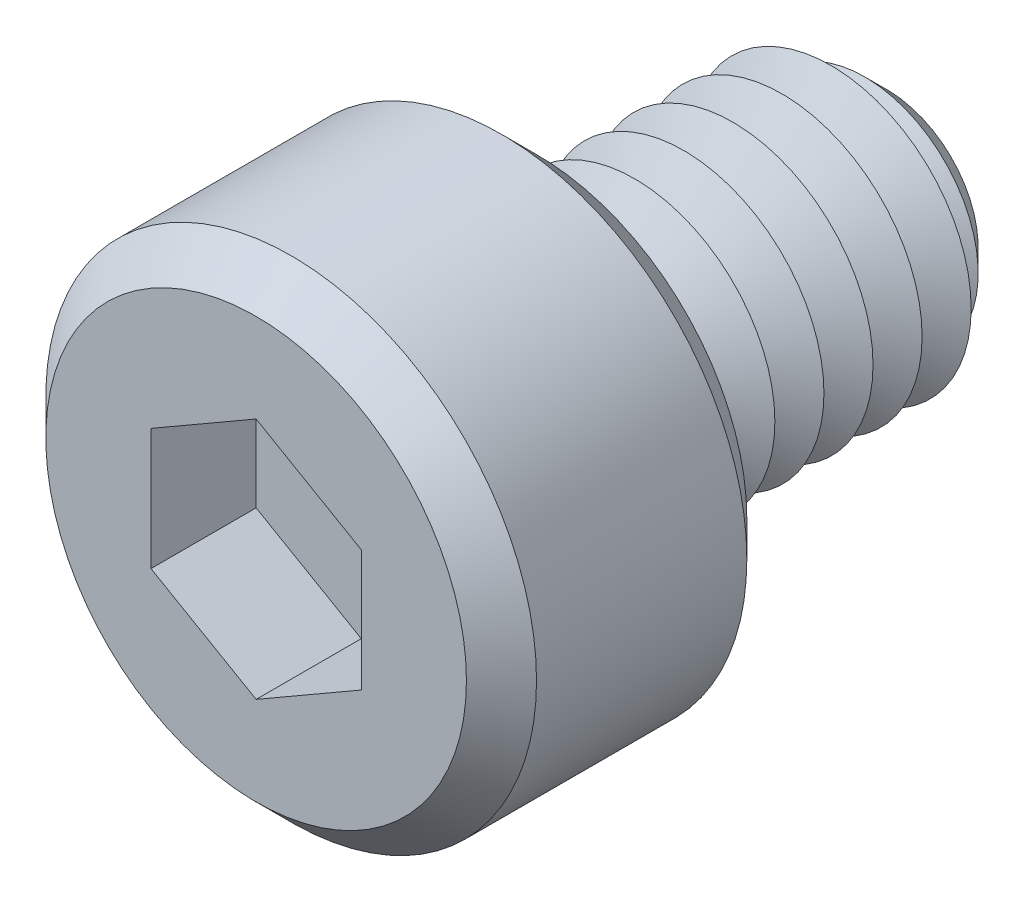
ISO-10303-21;
HEADER;
FILE_DESCRIPTION(('STEP AP214'),'2;1');
FILE_NAME('part.step','',(''),(''),'','','');
FILE_SCHEMA(('AUTOMOTIVE_DESIGN { 1 0 10303 214 1 1 1 1 }'));
ENDSEC;
DATA;
#1=APPLICATION_CONTEXT('core data for automotive mechanical design processes');
#2=APPLICATION_PROTOCOL_DEFINITION('international standard','automotive_design',2000,#1);
#3=PRODUCT_CONTEXT('',#1,'mechanical');
#4=PRODUCT('Part','Part','',(#3));
#5=PRODUCT_RELATED_PRODUCT_CATEGORY('part','',(#4));
#6=PRODUCT_DEFINITION_FORMATION('','',#4);
#7=PRODUCT_DEFINITION_CONTEXT('part definition',#1,'design');
#8=PRODUCT_DEFINITION('design','',#6,#7);
#9=PRODUCT_DEFINITION_SHAPE('','',#8);
#10=(LENGTH_UNIT() NAMED_UNIT(*) SI_UNIT(.MILLI.,.METRE.));
#11=(NAMED_UNIT(*) PLANE_ANGLE_UNIT() SI_UNIT($,.RADIAN.));
#12=(NAMED_UNIT(*) SI_UNIT($,.STERADIAN.) SOLID_ANGLE_UNIT());
#13=UNCERTAINTY_MEASURE_WITH_UNIT(LENGTH_MEASURE(1.E-05),#10,'distance_accuracy_value','');
#14=(GEOMETRIC_REPRESENTATION_CONTEXT(3) GLOBAL_UNCERTAINTY_ASSIGNED_CONTEXT((#13)) GLOBAL_UNIT_ASSIGNED_CONTEXT((#10,
#11,#12)) REPRESENTATION_CONTEXT('',''));
#15=CARTESIAN_POINT('',(0.,0.,0.));
#16=DIRECTION('',(0.,0.,1.));
#17=DIRECTION('',(1.,0.,0.));
#18=AXIS2_PLACEMENT_3D('',#15,#16,#17);
#19=CARTESIAN_POINT('',(0.,0.,4.));
#20=DIRECTION('',(0.,0.,-1.));
#21=DIRECTION('',(-1.,0.,0.));
#22=AXIS2_PLACEMENT_3D('',#19,#20,#21);
#23=CYLINDRICAL_SURFACE('',#22,3.5);
#24=CARTESIAN_POINT('',(0.,0.,0.5));
#25=DIRECTION('',(0.,0.,1.));
#26=DIRECTION('',(1.,0.,0.));
#27=AXIS2_PLACEMENT_3D('',#24,#25,#26);
#28=CIRCLE('',#27,3.5);
#29=CARTESIAN_POINT('',(3.5,0.,0.5));
#30=VERTEX_POINT('',#29);
#31=EDGE_CURVE('E232',#30,#30,#28,.T.);
#32=ORIENTED_EDGE('',*,*,#31,.T.);
#33=EDGE_LOOP('',(#32));
#34=FACE_BOUND('',#33,.T.);
#35=CARTESIAN_POINT('',(0.,0.,3.5));
#36=DIRECTION('',(0.,0.,1.));
#37=DIRECTION('',(1.,0.,0.));
#38=AXIS2_PLACEMENT_3D('',#35,#36,#37);
#39=CIRCLE('',#38,3.5);
#40=CARTESIAN_POINT('',(3.5,0.,3.5));
#41=VERTEX_POINT('',#40);
#42=EDGE_CURVE('E225',#41,#41,#39,.F.);
#43=ORIENTED_EDGE('',*,*,#42,.T.);
#44=EDGE_LOOP('',(#43));
#45=FACE_BOUND('',#44,.T.);
#46=ADVANCED_FACE('F39',(#34,#45),#23,.T.);
#47=CARTESIAN_POINT('',(0.,0.,4.));
#48=DIRECTION('',(0.,0.,1.));
#49=DIRECTION('',(1.,0.,0.));
#50=AXIS2_PLACEMENT_3D('',#47,#48,#49);
#51=PLANE('',#50);
#52=CARTESIAN_POINT('',(0.,0.,4.));
#53=DIRECTION('',(0.,0.,1.));
#54=DIRECTION('',(1.,0.,0.));
#55=AXIS2_PLACEMENT_3D('',#52,#53,#54);
#56=CIRCLE('',#55,3.);
#57=CARTESIAN_POINT('',(3.,0.,4.));
#58=VERTEX_POINT('',#57);
#59=EDGE_CURVE('E11',#58,#58,#56,.T.);
#60=ORIENTED_EDGE('',*,*,#59,.T.);
#61=EDGE_LOOP('',(#60));
#62=FACE_BOUND('',#61,.T.);
#63=DIRECTION('',(-0.866025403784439,0.5,0.));
#64=VECTOR('',#63,1.);
#65=CARTESIAN_POINT('',(1.5,0.86602540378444,4.));
#66=LINE('',#65,#64);
#67=CARTESIAN_POINT('',(1.5,0.86602540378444,4.));
#68=VERTEX_POINT('',#67);
#69=CARTESIAN_POINT('',(0.,1.73205080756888,4.));
#70=VERTEX_POINT('',#69);
#71=EDGE_CURVE('E55',#68,#70,#66,.T.);
#72=ORIENTED_EDGE('',*,*,#71,.F.);
#73=DIRECTION('',(0.,1.,0.));
#74=VECTOR('',#73,1.);
#75=CARTESIAN_POINT('',(1.5,-0.866025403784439,4.));
#76=LINE('',#75,#74);
#77=CARTESIAN_POINT('',(1.5,-0.866025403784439,4.));
#78=VERTEX_POINT('',#77);
#79=EDGE_CURVE('E151',#78,#68,#76,.T.);
#80=ORIENTED_EDGE('',*,*,#79,.F.);
#81=DIRECTION('',(0.866025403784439,0.5,0.));
#82=VECTOR('',#81,1.);
#83=CARTESIAN_POINT('',(0.,-1.73205080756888,4.));
#84=LINE('',#83,#82);
#85=CARTESIAN_POINT('',(0.,-1.73205080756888,4.));
#86=VERTEX_POINT('',#85);
#87=EDGE_CURVE('E148',#86,#78,#84,.T.);
#88=ORIENTED_EDGE('',*,*,#87,.F.);
#89=DIRECTION('',(0.866025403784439,-0.5,0.));
#90=VECTOR('',#89,1.);
#91=CARTESIAN_POINT('',(-1.5,-0.866025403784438,4.));
#92=LINE('',#91,#90);
#93=CARTESIAN_POINT('',(-1.5,-0.866025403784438,4.));
#94=VERTEX_POINT('',#93);
#95=EDGE_CURVE('E103',#94,#86,#92,.T.);
#96=ORIENTED_EDGE('',*,*,#95,.F.);
#97=DIRECTION('',(0.,-1.,0.));
#98=VECTOR('',#97,1.);
#99=CARTESIAN_POINT('',(-1.5,0.86602540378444,4.));
#100=LINE('',#99,#98);
#101=CARTESIAN_POINT('',(-1.5,0.86602540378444,4.));
#102=VERTEX_POINT('',#101);
#103=EDGE_CURVE('E142',#102,#94,#100,.T.);
#104=ORIENTED_EDGE('',*,*,#103,.F.);
#105=DIRECTION('',(-0.866025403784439,-0.5,0.));
#106=VECTOR('',#105,1.);
#107=CARTESIAN_POINT('',(0.,1.73205080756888,4.));
#108=LINE('',#107,#106);
#109=EDGE_CURVE('E137',#70,#102,#108,.T.);
#110=ORIENTED_EDGE('',*,*,#109,.F.);
#111=EDGE_LOOP('',(#72,#80,#88,#96,#104,#110));
#112=FACE_BOUND('',#111,.T.);
#113=ADVANCED_FACE('F250',(#62,#112),#51,.T.);
#114=CARTESIAN_POINT('',(0.,0.,0.));
#115=DIRECTION('',(0.,0.,1.));
#116=DIRECTION('',(1.,0.,0.));
#117=AXIS2_PLACEMENT_3D('',#114,#115,#116);
#118=PLANE('',#117);
#119=CARTESIAN_POINT('',(0.,0.,0.));
#120=DIRECTION('',(0.,0.,1.));
#121=DIRECTION('',(1.,0.,0.));
#122=AXIS2_PLACEMENT_3D('',#119,#120,#121);
#123=CIRCLE('',#122,3.);
#124=CARTESIAN_POINT('',(3.,0.,0.));
#125=VERTEX_POINT('',#124);
#126=EDGE_CURVE('E48',#125,#125,#123,.F.);
#127=ORIENTED_EDGE('',*,*,#126,.T.);
#128=EDGE_LOOP('',(#127));
#129=FACE_BOUND('',#128,.T.);
#130=CARTESIAN_POINT('',(0.,0.,0.));
#131=DIRECTION('',(0.,0.,1.));
#132=DIRECTION('',(1.,0.,0.));
#133=AXIS2_PLACEMENT_3D('',#130,#131,#132);
#134=CIRCLE('',#133,2.);
#135=CARTESIAN_POINT('',(2.,0.,0.));
#136=VERTEX_POINT('',#135);
#137=EDGE_CURVE('E218',#136,#136,#134,.T.);
#138=ORIENTED_EDGE('',*,*,#137,.T.);
#139=EDGE_LOOP('',(#138));
#140=FACE_BOUND('',#139,.T.);
#141=ADVANCED_FACE('F239',(#129,#140),#118,.F.);
#142=CARTESIAN_POINT('',(0.,0.,0.));
#143=DIRECTION('',(0.,0.,1.));
#144=DIRECTION('',(1.,0.,0.));
#145=AXIS2_PLACEMENT_3D('',#142,#143,#144);
#146=CONICAL_SURFACE('',#145,2.,1.0471975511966);
#147=CARTESIAN_POINT('',(0.,0.,-0.35));
#148=DIRECTION('',(0.,0.,1.));
#149=DIRECTION('',(1.,0.,0.));
#150=AXIS2_PLACEMENT_3D('',#147,#148,#149);
#151=CIRCLE('',#150,1.39378221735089);
#152=CARTESIAN_POINT('',(1.39378221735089,0.,-0.35));
#153=VERTEX_POINT('',#152);
#154=EDGE_CURVE('E214',#153,#153,#151,.T.);
#155=ORIENTED_EDGE('',*,*,#154,.T.);
#156=EDGE_LOOP('',(#155));
#157=FACE_BOUND('',#156,.T.);
#158=ORIENTED_EDGE('',*,*,#137,.F.);
#159=EDGE_LOOP('',(#158));
#160=FACE_BOUND('',#159,.T.);
#161=ADVANCED_FACE('F356',(#157,#160),#146,.T.);
#162=CARTESIAN_POINT('',(0.,0.,-0.35));
#163=DIRECTION('',(0.,0.,-1.));
#164=DIRECTION('',(-1.,0.,0.));
#165=AXIS2_PLACEMENT_3D('',#162,#163,#164);
#166=CONICAL_SURFACE('',#165,1.39378221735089,1.0471975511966);
#167=CARTESIAN_POINT('',(0.,0.,-0.7));
#168=DIRECTION('',(0.,0.,1.));
#169=DIRECTION('',(1.,0.,0.));
#170=AXIS2_PLACEMENT_3D('',#167,#168,#169);
#171=CIRCLE('',#170,2.);
#172=CARTESIAN_POINT('',(2.,0.,-0.7));
#173=VERTEX_POINT('',#172);
#174=EDGE_CURVE('E210',#173,#173,#171,.T.);
#175=ORIENTED_EDGE('',*,*,#174,.T.);
#176=EDGE_LOOP('',(#175));
#177=FACE_BOUND('',#176,.T.);
#178=ORIENTED_EDGE('',*,*,#154,.F.);
#179=EDGE_LOOP('',(#178));
#180=FACE_BOUND('',#179,.T.);
#181=ADVANCED_FACE('F352',(#177,#180),#166,.T.);
#182=CARTESIAN_POINT('',(0.,0.,-0.7));
#183=DIRECTION('',(0.,0.,1.));
#184=DIRECTION('',(1.,0.,0.));
#185=AXIS2_PLACEMENT_3D('',#182,#183,#184);
#186=CONICAL_SURFACE('',#185,2.,1.0471975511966);
#187=CARTESIAN_POINT('',(0.,0.,-1.05));
#188=DIRECTION('',(0.,0.,1.));
#189=DIRECTION('',(1.,0.,0.));
#190=AXIS2_PLACEMENT_3D('',#187,#188,#189);
#191=CIRCLE('',#190,1.39378221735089);
#192=CARTESIAN_POINT('',(1.39378221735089,0.,-1.05));
#193=VERTEX_POINT('',#192);
#194=EDGE_CURVE('E206',#193,#193,#191,.T.);
#195=ORIENTED_EDGE('',*,*,#194,.T.);
#196=EDGE_LOOP('',(#195));
#197=FACE_BOUND('',#196,.T.);
#198=ORIENTED_EDGE('',*,*,#174,.F.);
#199=EDGE_LOOP('',(#198));
#200=FACE_BOUND('',#199,.T.);
#201=ADVANCED_FACE('F348',(#197,#200),#186,.T.);
#202=CARTESIAN_POINT('',(0.,0.,-1.05));
#203=DIRECTION('',(0.,0.,-1.));
#204=DIRECTION('',(-1.,0.,0.));
#205=AXIS2_PLACEMENT_3D('',#202,#203,#204);
#206=CONICAL_SURFACE('',#205,1.39378221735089,1.0471975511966);
#207=CARTESIAN_POINT('',(0.,0.,-1.4));
#208=DIRECTION('',(0.,0.,1.));
#209=DIRECTION('',(1.,0.,0.));
#210=AXIS2_PLACEMENT_3D('',#207,#208,#209);
#211=CIRCLE('',#210,2.);
#212=CARTESIAN_POINT('',(2.,0.,-1.4));
#213=VERTEX_POINT('',#212);
#214=EDGE_CURVE('E202',#213,#213,#211,.T.);
#215=ORIENTED_EDGE('',*,*,#214,.T.);
#216=EDGE_LOOP('',(#215));
#217=FACE_BOUND('',#216,.T.);
#218=ORIENTED_EDGE('',*,*,#194,.F.);
#219=EDGE_LOOP('',(#218));
#220=FACE_BOUND('',#219,.T.);
#221=ADVANCED_FACE('F344',(#217,#220),#206,.T.);
#222=CARTESIAN_POINT('',(0.,0.,-1.4));
#223=DIRECTION('',(0.,0.,1.));
#224=DIRECTION('',(1.,0.,0.));
#225=AXIS2_PLACEMENT_3D('',#222,#223,#224);
#226=CONICAL_SURFACE('',#225,2.,1.0471975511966);
#227=CARTESIAN_POINT('',(0.,0.,-1.75));
#228=DIRECTION('',(0.,0.,1.));
#229=DIRECTION('',(1.,0.,0.));
#230=AXIS2_PLACEMENT_3D('',#227,#228,#229);
#231=CIRCLE('',#230,1.39378221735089);
#232=CARTESIAN_POINT('',(1.39378221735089,0.,-1.75));
#233=VERTEX_POINT('',#232);
#234=EDGE_CURVE('E199',#233,#233,#231,.T.);
#235=ORIENTED_EDGE('',*,*,#234,.T.);
#236=EDGE_LOOP('',(#235));
#237=FACE_BOUND('',#236,.T.);
#238=ORIENTED_EDGE('',*,*,#214,.F.);
#239=EDGE_LOOP('',(#238));
#240=FACE_BOUND('',#239,.T.);
#241=ADVANCED_FACE('F340',(#237,#240),#226,.T.);
#242=CARTESIAN_POINT('',(0.,0.,-1.75));
#243=DIRECTION('',(0.,0.,-1.));
#244=DIRECTION('',(-1.,0.,0.));
#245=AXIS2_PLACEMENT_3D('',#242,#243,#244);
#246=CONICAL_SURFACE('',#245,1.39378221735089,1.0471975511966);
#247=CARTESIAN_POINT('',(0.,0.,-2.1));
#248=DIRECTION('',(0.,0.,1.));
#249=DIRECTION('',(1.,0.,0.));
#250=AXIS2_PLACEMENT_3D('',#247,#248,#249);
#251=CIRCLE('',#250,2.);
#252=CARTESIAN_POINT('',(2.,0.,-2.1));
#253=VERTEX_POINT('',#252);
#254=EDGE_CURVE('E195',#253,#253,#251,.T.);
#255=ORIENTED_EDGE('',*,*,#254,.T.);
#256=EDGE_LOOP('',(#255));
#257=FACE_BOUND('',#256,.T.);
#258=ORIENTED_EDGE('',*,*,#234,.F.);
#259=EDGE_LOOP('',(#258));
#260=FACE_BOUND('',#259,.T.);
#261=ADVANCED_FACE('F336',(#257,#260),#246,.T.);
#262=CARTESIAN_POINT('',(0.,0.,-2.1));
#263=DIRECTION('',(0.,0.,1.));
#264=DIRECTION('',(1.,0.,0.));
#265=AXIS2_PLACEMENT_3D('',#262,#263,#264);
#266=CONICAL_SURFACE('',#265,2.,1.0471975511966);
#267=CARTESIAN_POINT('',(0.,0.,-2.45));
#268=DIRECTION('',(0.,0.,1.));
#269=DIRECTION('',(1.,0.,0.));
#270=AXIS2_PLACEMENT_3D('',#267,#268,#269);
#271=CIRCLE('',#270,1.39378221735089);
#272=CARTESIAN_POINT('',(1.39378221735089,0.,-2.45));
#273=VERTEX_POINT('',#272);
#274=EDGE_CURVE('E191',#273,#273,#271,.T.);
#275=ORIENTED_EDGE('',*,*,#274,.T.);
#276=EDGE_LOOP('',(#275));
#277=FACE_BOUND('',#276,.T.);
#278=ORIENTED_EDGE('',*,*,#254,.F.);
#279=EDGE_LOOP('',(#278));
#280=FACE_BOUND('',#279,.T.);
#281=ADVANCED_FACE('F332',(#277,#280),#266,.T.);
#282=CARTESIAN_POINT('',(0.,0.,-2.45));
#283=DIRECTION('',(0.,0.,-1.));
#284=DIRECTION('',(-1.,0.,0.));
#285=AXIS2_PLACEMENT_3D('',#282,#283,#284);
#286=CONICAL_SURFACE('',#285,1.39378221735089,1.0471975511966);
#287=CARTESIAN_POINT('',(0.,0.,-2.8));
#288=DIRECTION('',(0.,0.,1.));
#289=DIRECTION('',(1.,0.,0.));
#290=AXIS2_PLACEMENT_3D('',#287,#288,#289);
#291=CIRCLE('',#290,2.);
#292=CARTESIAN_POINT('',(2.,0.,-2.8));
#293=VERTEX_POINT('',#292);
#294=EDGE_CURVE('E187',#293,#293,#291,.T.);
#295=ORIENTED_EDGE('',*,*,#294,.T.);
#296=EDGE_LOOP('',(#295));
#297=FACE_BOUND('',#296,.T.);
#298=ORIENTED_EDGE('',*,*,#274,.F.);
#299=EDGE_LOOP('',(#298));
#300=FACE_BOUND('',#299,.T.);
#301=ADVANCED_FACE('F328',(#297,#300),#286,.T.);
#302=CARTESIAN_POINT('',(0.,0.,-2.8));
#303=DIRECTION('',(0.,0.,1.));
#304=DIRECTION('',(1.,0.,0.));
#305=AXIS2_PLACEMENT_3D('',#302,#303,#304);
#306=CONICAL_SURFACE('',#305,2.,1.0471975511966);
#307=CARTESIAN_POINT('',(0.,0.,-3.15));
#308=DIRECTION('',(0.,0.,1.));
#309=DIRECTION('',(1.,0.,0.));
#310=AXIS2_PLACEMENT_3D('',#307,#308,#309);
#311=CIRCLE('',#310,1.39378221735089);
#312=CARTESIAN_POINT('',(1.39378221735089,0.,-3.15));
#313=VERTEX_POINT('',#312);
#314=EDGE_CURVE('E183',#313,#313,#311,.T.);
#315=ORIENTED_EDGE('',*,*,#314,.T.);
#316=EDGE_LOOP('',(#315));
#317=FACE_BOUND('',#316,.T.);
#318=ORIENTED_EDGE('',*,*,#294,.F.);
#319=EDGE_LOOP('',(#318));
#320=FACE_BOUND('',#319,.T.);
#321=ADVANCED_FACE('F324',(#317,#320),#306,.T.);
#322=CARTESIAN_POINT('',(0.,0.,-3.15));
#323=DIRECTION('',(0.,0.,-1.));
#324=DIRECTION('',(-1.,0.,0.));
#325=AXIS2_PLACEMENT_3D('',#322,#323,#324);
#326=CONICAL_SURFACE('',#325,1.39378221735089,1.0471975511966);
#327=CARTESIAN_POINT('',(0.,0.,-3.5));
#328=DIRECTION('',(0.,0.,1.));
#329=DIRECTION('',(1.,0.,0.));
#330=AXIS2_PLACEMENT_3D('',#327,#328,#329);
#331=CIRCLE('',#330,2.);
#332=CARTESIAN_POINT('',(2.,0.,-3.5));
#333=VERTEX_POINT('',#332);
#334=EDGE_CURVE('E179',#333,#333,#331,.T.);
#335=ORIENTED_EDGE('',*,*,#334,.T.);
#336=EDGE_LOOP('',(#335));
#337=FACE_BOUND('',#336,.T.);
#338=ORIENTED_EDGE('',*,*,#314,.F.);
#339=EDGE_LOOP('',(#338));
#340=FACE_BOUND('',#339,.T.);
#341=ADVANCED_FACE('F320',(#337,#340),#326,.T.);
#342=CARTESIAN_POINT('',(0.,0.,-3.5));
#343=DIRECTION('',(0.,0.,1.));
#344=DIRECTION('',(1.,0.,0.));
#345=AXIS2_PLACEMENT_3D('',#342,#343,#344);
#346=CONICAL_SURFACE('',#345,2.,1.0471975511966);
#347=CARTESIAN_POINT('',(0.,0.,-3.85));
#348=DIRECTION('',(0.,0.,1.));
#349=DIRECTION('',(1.,0.,0.));
#350=AXIS2_PLACEMENT_3D('',#347,#348,#349);
#351=CIRCLE('',#350,1.39378221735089);
#352=CARTESIAN_POINT('',(1.39378221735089,0.,-3.85));
#353=VERTEX_POINT('',#352);
#354=EDGE_CURVE('E175',#353,#353,#351,.T.);
#355=ORIENTED_EDGE('',*,*,#354,.T.);
#356=EDGE_LOOP('',(#355));
#357=FACE_BOUND('',#356,.T.);
#358=ORIENTED_EDGE('',*,*,#334,.F.);
#359=EDGE_LOOP('',(#358));
#360=FACE_BOUND('',#359,.T.);
#361=ADVANCED_FACE('F316',(#357,#360),#346,.T.);
#362=CARTESIAN_POINT('',(0.,0.,-3.85));
#363=DIRECTION('',(0.,0.,-1.));
#364=DIRECTION('',(-1.,0.,0.));
#365=AXIS2_PLACEMENT_3D('',#362,#363,#364);
#366=CONICAL_SURFACE('',#365,1.39378221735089,1.0471975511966);
#367=CARTESIAN_POINT('',(0.,0.,-4.2));
#368=DIRECTION('',(0.,0.,1.));
#369=DIRECTION('',(1.,0.,0.));
#370=AXIS2_PLACEMENT_3D('',#367,#368,#369);
#371=CIRCLE('',#370,2.);
#372=CARTESIAN_POINT('',(2.,0.,-4.2));
#373=VERTEX_POINT('',#372);
#374=EDGE_CURVE('E170',#373,#373,#371,.T.);
#375=ORIENTED_EDGE('',*,*,#374,.T.);
#376=EDGE_LOOP('',(#375));
#377=FACE_BOUND('',#376,.T.);
#378=ORIENTED_EDGE('',*,*,#354,.F.);
#379=EDGE_LOOP('',(#378));
#380=FACE_BOUND('',#379,.T.);
#381=ADVANCED_FACE('F312',(#377,#380),#366,.T.);
#382=CARTESIAN_POINT('',(0.,0.,-4.2));
#383=DIRECTION('',(0.,0.,1.));
#384=DIRECTION('',(1.,0.,0.));
#385=AXIS2_PLACEMENT_3D('',#382,#383,#384);
#386=CONICAL_SURFACE('',#385,2.,1.0471975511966);
#387=CARTESIAN_POINT('',(0.,0.,-4.55));
#388=DIRECTION('',(0.,0.,1.));
#389=DIRECTION('',(1.,0.,0.));
#390=AXIS2_PLACEMENT_3D('',#387,#388,#389);
#391=CIRCLE('',#390,1.39378221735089);
#392=CARTESIAN_POINT('',(1.39378221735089,0.,-4.55));
#393=VERTEX_POINT('',#392);
#394=EDGE_CURVE('E157',#393,#393,#391,.T.);
#395=ORIENTED_EDGE('',*,*,#394,.T.);
#396=EDGE_LOOP('',(#395));
#397=FACE_BOUND('',#396,.T.);
#398=ORIENTED_EDGE('',*,*,#374,.F.);
#399=EDGE_LOOP('',(#398));
#400=FACE_BOUND('',#399,.T.);
#401=ADVANCED_FACE('F308',(#397,#400),#386,.T.);
#402=CARTESIAN_POINT('',(0.,0.,-4.55));
#403=DIRECTION('',(0.,0.,-1.));
#404=DIRECTION('',(-1.,0.,0.));
#405=AXIS2_PLACEMENT_3D('',#402,#403,#404);
#406=CONICAL_SURFACE('',#405,1.39378221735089,1.0471975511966);
#407=CARTESIAN_POINT('',(0.,0.,-4.68038475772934));
#408=DIRECTION('',(0.,0.,-1.));
#409=DIRECTION('',(-1.,0.,0.));
#410=AXIS2_PLACEMENT_3D('',#407,#408,#409);
#411=CIRCLE('',#410,1.61961524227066);
#412=CARTESIAN_POINT('',(-1.61961524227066,0.,-4.68038475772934));
#413=VERTEX_POINT('',#412);
#414=EDGE_CURVE('E174',#413,#413,#411,.T.);
#415=ORIENTED_EDGE('',*,*,#414,.F.);
#416=EDGE_LOOP('',(#415));
#417=FACE_BOUND('',#416,.T.);
#418=ORIENTED_EDGE('',*,*,#394,.F.);
#419=EDGE_LOOP('',(#418));
#420=FACE_BOUND('',#419,.T.);
#421=ADVANCED_FACE('F304',(#417,#420),#406,.T.);
#422=CARTESIAN_POINT('',(0.,0.,-5.));
#423=DIRECTION('',(0.,0.,-1.));
#424=DIRECTION('',(-1.,0.,0.));
#425=AXIS2_PLACEMENT_3D('',#422,#423,#424);
#426=PLANE('',#425);
#427=CARTESIAN_POINT('',(0.,0.,-5.));
#428=DIRECTION('',(0.,0.,-1.));
#429=DIRECTION('',(-1.,0.,0.));
#430=AXIS2_PLACEMENT_3D('',#427,#428,#429);
#431=CIRCLE('',#430,0.5);
#432=CARTESIAN_POINT('',(-0.5,0.,-5.));
#433=VERTEX_POINT('',#432);
#434=EDGE_CURVE('E138',#433,#433,#431,.F.);
#435=ORIENTED_EDGE('',*,*,#434,.T.);
#436=EDGE_LOOP('',(#435));
#437=FACE_BOUND('',#436,.T.);
#438=CARTESIAN_POINT('',(0.,0.,-5.));
#439=DIRECTION('',(0.,0.,-1.));
#440=DIRECTION('',(-1.,0.,0.));
#441=AXIS2_PLACEMENT_3D('',#438,#439,#440);
#442=CIRCLE('',#441,1.3);
#443=CARTESIAN_POINT('',(-1.3,0.,-5.));
#444=VERTEX_POINT('',#443);
#445=EDGE_CURVE('E222',#444,#444,#442,.T.);
#446=ORIENTED_EDGE('',*,*,#445,.T.);
#447=EDGE_LOOP('',(#446));
#448=FACE_BOUND('',#447,.T.);
#449=ADVANCED_FACE('F307',(#437,#448),#426,.T.);
#450=CARTESIAN_POINT('',(0.,0.,-5.));
#451=DIRECTION('',(0.,0.,1.));
#452=DIRECTION('',(1.,0.,0.));
#453=AXIS2_PLACEMENT_3D('',#450,#451,#452);
#454=CONICAL_SURFACE('',#453,1.3,0.785398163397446);
#455=ORIENTED_EDGE('',*,*,#445,.F.);
#456=EDGE_LOOP('',(#455));
#457=FACE_BOUND('',#456,.T.);
#458=ORIENTED_EDGE('',*,*,#414,.T.);
#459=EDGE_LOOP('',(#458));
#460=FACE_BOUND('',#459,.T.);
#461=ADVANCED_FACE('F303',(#457,#460),#454,.T.);
#462=CARTESIAN_POINT('',(1.5,0.86602540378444,2.5));
#463=DIRECTION('',(0.5,0.866025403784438,0.));
#464=DIRECTION('',(-0.866025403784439,0.5,0.));
#465=AXIS2_PLACEMENT_3D('',#462,#463,#464);
#466=PLANE('',#465);
#467=ORIENTED_EDGE('',*,*,#71,.T.);
#468=DIRECTION('',(0.,0.,1.));
#469=VECTOR('',#468,1.);
#470=CARTESIAN_POINT('',(0.,1.73205080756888,2.5));
#471=LINE('',#470,#469);
#472=CARTESIAN_POINT('',(0.,1.73205080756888,2.5));
#473=VERTEX_POINT('',#472);
#474=EDGE_CURVE('E85',#473,#70,#471,.T.);
#475=ORIENTED_EDGE('',*,*,#474,.F.);
#476=DIRECTION('',(-0.866025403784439,0.5,0.));
#477=VECTOR('',#476,1.);
#478=CARTESIAN_POINT('',(1.5,0.86602540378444,2.5));
#479=LINE('',#478,#477);
#480=CARTESIAN_POINT('',(1.5,0.86602540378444,2.5));
#481=VERTEX_POINT('',#480);
#482=EDGE_CURVE('E154',#481,#473,#479,.T.);
#483=ORIENTED_EDGE('',*,*,#482,.F.);
#484=DIRECTION('',(0.,0.,1.));
#485=VECTOR('',#484,1.);
#486=CARTESIAN_POINT('',(1.5,0.86602540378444,2.5));
#487=LINE('',#486,#485);
#488=EDGE_CURVE('E63',#481,#68,#487,.T.);
#489=ORIENTED_EDGE('',*,*,#488,.T.);
#490=EDGE_LOOP('',(#467,#475,#483,#489));
#491=FACE_BOUND('',#490,.T.);
#492=ADVANCED_FACE('F293',(#491),#466,.F.);
#493=CARTESIAN_POINT('',(1.5,-0.866025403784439,2.5));
#494=DIRECTION('',(1.,0.,0.));
#495=DIRECTION('',(0.,0.,-1.));
#496=AXIS2_PLACEMENT_3D('',#493,#494,#495);
#497=PLANE('',#496);
#498=ORIENTED_EDGE('',*,*,#79,.T.);
#499=ORIENTED_EDGE('',*,*,#488,.F.);
#500=DIRECTION('',(0.,1.,0.));
#501=VECTOR('',#500,1.);
#502=CARTESIAN_POINT('',(1.5,-0.866025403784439,2.5));
#503=LINE('',#502,#501);
#504=CARTESIAN_POINT('',(1.5,-0.866025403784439,2.5));
#505=VERTEX_POINT('',#504);
#506=EDGE_CURVE('E117',#505,#481,#503,.T.);
#507=ORIENTED_EDGE('',*,*,#506,.F.);
#508=DIRECTION('',(0.,0.,1.));
#509=VECTOR('',#508,1.);
#510=CARTESIAN_POINT('',(1.5,-0.866025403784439,2.5));
#511=LINE('',#510,#509);
#512=EDGE_CURVE('E108',#505,#78,#511,.T.);
#513=ORIENTED_EDGE('',*,*,#512,.T.);
#514=EDGE_LOOP('',(#498,#499,#507,#513));
#515=FACE_BOUND('',#514,.T.);
#516=ADVANCED_FACE('F290',(#515),#497,.F.);
#517=CARTESIAN_POINT('',(0.,-1.73205080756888,2.5));
#518=DIRECTION('',(0.5,-0.866025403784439,0.));
#519=DIRECTION('',(0.866025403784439,0.5,0.));
#520=AXIS2_PLACEMENT_3D('',#517,#518,#519);
#521=PLANE('',#520);
#522=ORIENTED_EDGE('',*,*,#87,.T.);
#523=ORIENTED_EDGE('',*,*,#512,.F.);
#524=DIRECTION('',(0.866025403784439,0.5,0.));
#525=VECTOR('',#524,1.);
#526=CARTESIAN_POINT('',(0.,-1.73205080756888,2.5));
#527=LINE('',#526,#525);
#528=CARTESIAN_POINT('',(0.,-1.73205080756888,2.5));
#529=VERTEX_POINT('',#528);
#530=EDGE_CURVE('E112',#529,#505,#527,.T.);
#531=ORIENTED_EDGE('',*,*,#530,.F.);
#532=DIRECTION('',(0.,0.,1.));
#533=VECTOR('',#532,1.);
#534=CARTESIAN_POINT('',(0.,-1.73205080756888,2.5));
#535=LINE('',#534,#533);
#536=EDGE_CURVE('E96',#529,#86,#535,.T.);
#537=ORIENTED_EDGE('',*,*,#536,.T.);
#538=EDGE_LOOP('',(#522,#523,#531,#537));
#539=FACE_BOUND('',#538,.T.);
#540=ADVANCED_FACE('F113',(#539),#521,.F.);
#541=CARTESIAN_POINT('',(-1.5,-0.866025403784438,2.5));
#542=DIRECTION('',(-0.5,-0.866025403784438,0.));
#543=DIRECTION('',(0.866025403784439,-0.5,0.));
#544=AXIS2_PLACEMENT_3D('',#541,#542,#543);
#545=PLANE('',#544);
#546=ORIENTED_EDGE('',*,*,#95,.T.);
#547=ORIENTED_EDGE('',*,*,#536,.F.);
#548=DIRECTION('',(0.866025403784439,-0.5,0.));
#549=VECTOR('',#548,1.);
#550=CARTESIAN_POINT('',(-1.5,-0.866025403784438,2.5));
#551=LINE('',#550,#549);
#552=CARTESIAN_POINT('',(-1.5,-0.866025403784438,2.5));
#553=VERTEX_POINT('',#552);
#554=EDGE_CURVE('E100',#553,#529,#551,.T.);
#555=ORIENTED_EDGE('',*,*,#554,.F.);
#556=DIRECTION('',(0.,0.,1.));
#557=VECTOR('',#556,1.);
#558=CARTESIAN_POINT('',(-1.5,-0.866025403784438,2.5));
#559=LINE('',#558,#557);
#560=EDGE_CURVE('E109',#553,#94,#559,.T.);
#561=ORIENTED_EDGE('',*,*,#560,.T.);
#562=EDGE_LOOP('',(#546,#547,#555,#561));
#563=FACE_BOUND('',#562,.T.);
#564=ADVANCED_FACE('F98',(#563),#545,.F.);
#565=CARTESIAN_POINT('',(-1.5,0.86602540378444,2.5));
#566=DIRECTION('',(-1.,0.,0.));
#567=DIRECTION('',(0.,0.,1.));
#568=AXIS2_PLACEMENT_3D('',#565,#566,#567);
#569=PLANE('',#568);
#570=ORIENTED_EDGE('',*,*,#103,.T.);
#571=ORIENTED_EDGE('',*,*,#560,.F.);
#572=DIRECTION('',(0.,-1.,0.));
#573=VECTOR('',#572,1.);
#574=CARTESIAN_POINT('',(-1.5,0.86602540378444,2.5));
#575=LINE('',#574,#573);
#576=CARTESIAN_POINT('',(-1.5,0.86602540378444,2.5));
#577=VERTEX_POINT('',#576);
#578=EDGE_CURVE('E123',#577,#553,#575,.T.);
#579=ORIENTED_EDGE('',*,*,#578,.F.);
#580=DIRECTION('',(0.,0.,1.));
#581=VECTOR('',#580,1.);
#582=CARTESIAN_POINT('',(-1.5,0.86602540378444,2.5));
#583=LINE('',#582,#581);
#584=EDGE_CURVE('E162',#577,#102,#583,.T.);
#585=ORIENTED_EDGE('',*,*,#584,.T.);
#586=EDGE_LOOP('',(#570,#571,#579,#585));
#587=FACE_BOUND('',#586,.T.);
#588=ADVANCED_FACE('F287',(#587),#569,.F.);
#589=CARTESIAN_POINT('',(0.,1.73205080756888,2.5));
#590=DIRECTION('',(-0.5,0.866025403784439,0.));
#591=DIRECTION('',(-0.866025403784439,-0.5,0.));
#592=AXIS2_PLACEMENT_3D('',#589,#590,#591);
#593=PLANE('',#592);
#594=ORIENTED_EDGE('',*,*,#109,.T.);
#595=ORIENTED_EDGE('',*,*,#584,.F.);
#596=DIRECTION('',(-0.866025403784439,-0.5,0.));
#597=VECTOR('',#596,1.);
#598=CARTESIAN_POINT('',(0.,1.73205080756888,2.5));
#599=LINE('',#598,#597);
#600=EDGE_CURVE('E129',#473,#577,#599,.T.);
#601=ORIENTED_EDGE('',*,*,#600,.F.);
#602=ORIENTED_EDGE('',*,*,#474,.T.);
#603=EDGE_LOOP('',(#594,#595,#601,#602));
#604=FACE_BOUND('',#603,.T.);
#605=ADVANCED_FACE('F265',(#604),#593,.F.);
#606=CARTESIAN_POINT('',(0.,0.,2.5));
#607=DIRECTION('',(0.,0.,1.));
#608=DIRECTION('',(1.,0.,0.));
#609=AXIS2_PLACEMENT_3D('',#606,#607,#608);
#610=PLANE('',#609);
#611=CARTESIAN_POINT('',(0.,0.,2.5));
#612=DIRECTION('',(0.,0.,1.));
#613=DIRECTION('',(1.,0.,0.));
#614=AXIS2_PLACEMENT_3D('',#611,#612,#613);
#615=CIRCLE('',#614,0.5);
#616=CARTESIAN_POINT('',(0.5,0.,2.5));
#617=VERTEX_POINT('',#616);
#618=EDGE_CURVE('E273',#617,#617,#615,.T.);
#619=ORIENTED_EDGE('',*,*,#618,.F.);
#620=EDGE_LOOP('',(#619));
#621=FACE_BOUND('',#620,.T.);
#622=ORIENTED_EDGE('',*,*,#482,.T.);
#623=ORIENTED_EDGE('',*,*,#600,.T.);
#624=ORIENTED_EDGE('',*,*,#578,.T.);
#625=ORIENTED_EDGE('',*,*,#554,.T.);
#626=ORIENTED_EDGE('',*,*,#530,.T.);
#627=ORIENTED_EDGE('',*,*,#506,.T.);
#628=EDGE_LOOP('',(#622,#623,#624,#625,#626,#627));
#629=FACE_BOUND('',#628,.T.);
#630=ADVANCED_FACE('F120',(#621,#629),#610,.T.);
#631=CARTESIAN_POINT('',(0.,0.,-6.41421356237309));
#632=DIRECTION('',(0.,0.,1.));
#633=DIRECTION('',(1.,0.,0.));
#634=AXIS2_PLACEMENT_3D('',#631,#632,#633);
#635=CYLINDRICAL_SURFACE('',#634,0.5);
#636=ORIENTED_EDGE('',*,*,#618,.T.);
#637=EDGE_LOOP('',(#636));
#638=FACE_BOUND('',#637,.T.);
#639=ORIENTED_EDGE('',*,*,#434,.F.);
#640=EDGE_LOOP('',(#639));
#641=FACE_BOUND('',#640,.T.);
#642=ADVANCED_FACE('F245',(#638,#641),#635,.F.);
#643=CARTESIAN_POINT('',(0.,0.,0.5));
#644=DIRECTION('',(0.,0.,1.));
#645=DIRECTION('',(1.,0.,0.));
#646=AXIS2_PLACEMENT_3D('',#643,#644,#645);
#647=CONICAL_SURFACE('',#646,3.5,0.78539816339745);
#648=ORIENTED_EDGE('',*,*,#126,.F.);
#649=EDGE_LOOP('',(#648));
#650=FACE_BOUND('',#649,.T.);
#651=ORIENTED_EDGE('',*,*,#31,.F.);
#652=EDGE_LOOP('',(#651));
#653=FACE_BOUND('',#652,.T.);
#654=ADVANCED_FACE('F242',(#650,#653),#647,.T.);
#655=CARTESIAN_POINT('',(0.,0.,4.));
#656=DIRECTION('',(0.,0.,-1.));
#657=DIRECTION('',(-1.,0.,0.));
#658=AXIS2_PLACEMENT_3D('',#655,#656,#657);
#659=CONICAL_SURFACE('',#658,3.,0.785398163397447);
#660=ORIENTED_EDGE('',*,*,#42,.F.);
#661=EDGE_LOOP('',(#660));
#662=FACE_BOUND('',#661,.T.);
#663=ORIENTED_EDGE('',*,*,#59,.F.);
#664=EDGE_LOOP('',(#663));
#665=FACE_BOUND('',#664,.T.);
#666=ADVANCED_FACE('F41',(#662,#665),#659,.T.);
#667=CLOSED_SHELL('',(#46,#113,#141,#161,#181,#201,#221,#241,#261,#281,#301,#321,#341,#361,#381,
#401,#421,#449,#461,#492,#516,#540,#564,#588,#605,#630,#642,#654,#666));
#668=MANIFOLD_SOLID_BREP('B2',#667);
#669=ADVANCED_BREP_SHAPE_REPRESENTATION('',(#18,#668),#14);
#670=SHAPE_DEFINITION_REPRESENTATION(#9,#669);
ENDSEC;
END-ISO-10303-21;
